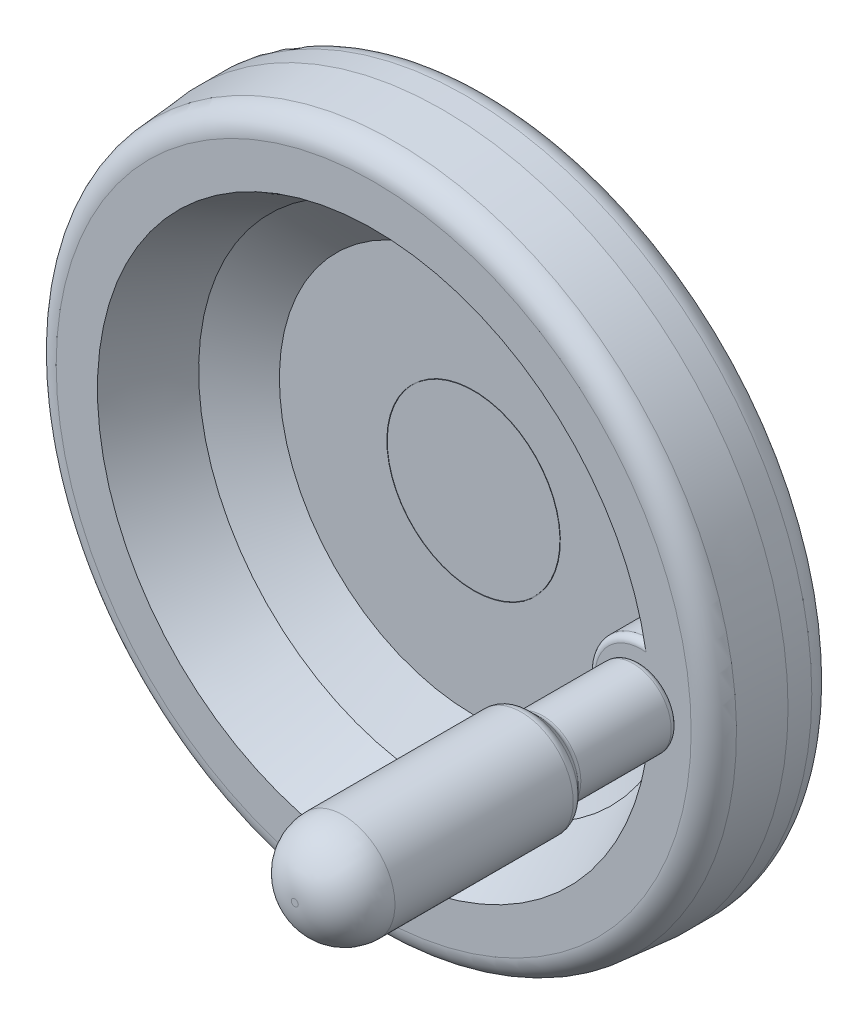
ISO-10303-21;
HEADER;
FILE_DESCRIPTION(('STEP AP214'),'2;1');
FILE_NAME('part.step','',(''),(''),'','','');
FILE_SCHEMA(('AUTOMOTIVE_DESIGN { 1 0 10303 214 1 1 1 1 }'));
ENDSEC;
DATA;
#1=APPLICATION_CONTEXT('core data for automotive mechanical design processes');
#2=APPLICATION_PROTOCOL_DEFINITION('international standard','automotive_design',2000,#1);
#3=PRODUCT_CONTEXT('',#1,'mechanical');
#4=PRODUCT('Part','Part','',(#3));
#5=PRODUCT_RELATED_PRODUCT_CATEGORY('part','',(#4));
#6=PRODUCT_DEFINITION_FORMATION('','',#4);
#7=PRODUCT_DEFINITION_CONTEXT('part definition',#1,'design');
#8=PRODUCT_DEFINITION('design','',#6,#7);
#9=PRODUCT_DEFINITION_SHAPE('','',#8);
#10=(LENGTH_UNIT() NAMED_UNIT(*) SI_UNIT(.MILLI.,.METRE.));
#11=(NAMED_UNIT(*) PLANE_ANGLE_UNIT() SI_UNIT($,.RADIAN.));
#12=(NAMED_UNIT(*) SI_UNIT($,.STERADIAN.) SOLID_ANGLE_UNIT());
#13=UNCERTAINTY_MEASURE_WITH_UNIT(LENGTH_MEASURE(1.E-05),#10,'distance_accuracy_value','');
#14=(GEOMETRIC_REPRESENTATION_CONTEXT(3) GLOBAL_UNCERTAINTY_ASSIGNED_CONTEXT((#13)) GLOBAL_UNIT_ASSIGNED_CONTEXT((#10,
#11,#12)) REPRESENTATION_CONTEXT('',''));
#15=CARTESIAN_POINT('',(0.,0.,0.));
#16=DIRECTION('',(0.,0.,1.));
#17=DIRECTION('',(1.,0.,0.));
#18=AXIS2_PLACEMENT_3D('',#15,#16,#17);
#19=CARTESIAN_POINT('',(64.,0.,64.));
#20=DIRECTION('',(0.,0.,-1.));
#21=DIRECTION('',(0.,1.,0.));
#22=AXIS2_PLACEMENT_3D('',#19,#20,#21);
#23=PLANE('',#22);
#24=CARTESIAN_POINT('',(0.,0.,64.));
#25=DIRECTION('',(0.,0.,1.));
#26=DIRECTION('',(0.,-1.,0.));
#27=AXIS2_PLACEMENT_3D('',#24,#25,#26);
#28=CIRCLE('',#27,73.560359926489);
#29=CARTESIAN_POINT('',(0.,-73.560359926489,64.));
#30=VERTEX_POINT('',#29);
#31=EDGE_CURVE('E54',#30,#30,#28,.T.);
#32=ORIENTED_EDGE('',*,*,#31,.T.);
#33=EDGE_LOOP('',(#32));
#34=FACE_BOUND('',#33,.T.);
#35=CARTESIAN_POINT('',(0.,0.,64.));
#36=DIRECTION('',(0.,0.,1.));
#37=DIRECTION('',(0.,-1.,0.));
#38=AXIS2_PLACEMENT_3D('',#35,#36,#37);
#39=CIRCLE('',#38,64.);
#40=CARTESIAN_POINT('',(63.1003024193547,10.6935417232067,64.));
#41=VERTEX_POINT('',#40);
#42=CARTESIAN_POINT('',(63.1003024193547,-10.6935417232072,64.));
#43=VERTEX_POINT('',#42);
#44=EDGE_CURVE('E49',#41,#43,#39,.T.);
#45=ORIENTED_EDGE('',*,*,#44,.F.);
#46=CARTESIAN_POINT('',(62.,0.,64.));
#47=DIRECTION('',(0.,0.,-1.));
#48=DIRECTION('',(0.,1.,0.));
#49=AXIS2_PLACEMENT_3D('',#46,#47,#48);
#50=CIRCLE('',#49,10.75);
#51=EDGE_CURVE('E52',#43,#41,#50,.T.);
#52=ORIENTED_EDGE('',*,*,#51,.F.);
#53=EDGE_LOOP('',(#45,#52));
#54=FACE_BOUND('',#53,.T.);
#55=CARTESIAN_POINT('',(62.,0.,64.));
#56=DIRECTION('',(0.,0.,-1.));
#57=DIRECTION('',(0.,1.,0.));
#58=AXIS2_PLACEMENT_3D('',#55,#56,#57);
#59=CIRCLE('',#58,4.);
#60=CARTESIAN_POINT('',(62.,4.,64.));
#61=VERTEX_POINT('',#60);
#62=EDGE_CURVE('E9',#61,#61,#59,.F.);
#63=ORIENTED_EDGE('',*,*,#62,.F.);
#64=EDGE_LOOP('',(#63));
#65=FACE_BOUND('',#64,.T.);
#66=ADVANCED_FACE('F14',(#34,#54,#65),#23,.F.);
#67=CARTESIAN_POINT('',(0.,0.,48.552282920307));
#68=DIRECTION('',(0.,0.,1.));
#69=DIRECTION('',(0.,-1.,0.));
#70=AXIS2_PLACEMENT_3D('',#67,#68,#69);
#71=CONICAL_SURFACE('',#70,56.,0.959931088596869);
#72=CARTESIAN_POINT('',(0.,0.,40.85));
#73=DIRECTION('',(0.,0.,1.));
#74=DIRECTION('',(0.,-1.,0.));
#75=AXIS2_PLACEMENT_3D('',#72,#73,#74);
#76=CIRCLE('',#75,45.);
#77=CARTESIAN_POINT('',(0.,-45.,40.85));
#78=VERTEX_POINT('',#77);
#79=EDGE_CURVE('E128',#78,#78,#76,.T.);
#80=ORIENTED_EDGE('',*,*,#79,.F.);
#81=EDGE_LOOP('',(#80));
#82=FACE_BOUND('',#81,.T.);
#83=CARTESIAN_POINT('',(55.0803991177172,10.1084926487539,48.552482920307));
#84=CARTESIAN_POINT('',(54.7990560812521,9.91588103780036,48.3343994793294));
#85=CARTESIAN_POINT('',(54.5240166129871,9.71037558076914,48.1193417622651));
#86=CARTESIAN_POINT('',(53.9882416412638,9.27329783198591,47.6970470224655));
#87=CARTESIAN_POINT('',(53.7275259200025,9.04169077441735,47.4898209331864));
#88=CARTESIAN_POINT('',(53.2206638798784,8.55051709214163,47.0837945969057));
#89=CARTESIAN_POINT('',(52.9746644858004,8.2907242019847,46.8850836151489));
#90=CARTESIAN_POINT('',(52.5023397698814,7.74513027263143,46.5006942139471));
#91=CARTESIAN_POINT('',(52.276003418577,7.45934400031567,46.315008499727));
#92=CARTESIAN_POINT('',(51.8915189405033,6.92568134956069,45.9973838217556));
#93=CARTESIAN_POINT('',(51.7291070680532,6.68267129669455,45.8624137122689));
#94=CARTESIAN_POINT('',(51.4197321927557,6.18119654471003,45.6039982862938));
#95=CARTESIAN_POINT('',(51.2727660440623,5.92273500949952,45.4805506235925));
#96=CARTESIAN_POINT('',(50.99638776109,5.39187168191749,45.2473296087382));
#97=CARTESIAN_POINT('',(50.8669208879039,5.11951721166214,45.1375137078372));
#98=CARTESIAN_POINT('',(50.6267665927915,4.56117991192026,44.9329951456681));
#99=CARTESIAN_POINT('',(50.5160761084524,4.27519931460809,44.8382900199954));
#100=CARTESIAN_POINT('',(50.3303753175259,3.73512802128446,44.678880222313));
#101=CARTESIAN_POINT('',(50.2525021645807,3.48271880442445,44.6118054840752));
#102=CARTESIAN_POINT('',(50.112630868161,2.97042488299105,44.4910525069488));
#103=CARTESIAN_POINT('',(50.0506298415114,2.71054154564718,44.4373718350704));
#104=CARTESIAN_POINT('',(49.9434134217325,2.18476653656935,44.3443863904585));
#105=CARTESIAN_POINT('',(49.8981994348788,1.91887436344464,44.3050828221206));
#106=CARTESIAN_POINT('',(49.82530268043,1.38289038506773,44.2416490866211));
#107=CARTESIAN_POINT('',(49.7976200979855,1.11279853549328,44.2175190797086));
#108=CARTESIAN_POINT('',(49.7602202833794,0.569709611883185,44.1849069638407));
#109=CARTESIAN_POINT('',(49.7505504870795,0.29670676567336,44.1764661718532));
#110=CARTESIAN_POINT('',(49.7494952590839,-0.249361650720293,44.1755453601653));
#111=CARTESIAN_POINT('',(49.758109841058,-0.522427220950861,44.1830653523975));
#112=CARTESIAN_POINT('',(49.7934676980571,-1.06648410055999,44.2138993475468));
#113=CARTESIAN_POINT('',(49.8202115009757,-1.33747534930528,44.2372138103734));
#114=CARTESIAN_POINT('',(49.8913596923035,-1.87534679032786,44.2991351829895));
#115=CARTESIAN_POINT('',(49.9357640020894,-2.14222700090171,44.3377420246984));
#116=CARTESIAN_POINT('',(50.0393527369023,-2.65934587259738,44.4275998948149));
#117=CARTESIAN_POINT('',(50.0978649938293,-2.90982056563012,44.4782748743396));
#118=CARTESIAN_POINT('',(50.2296486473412,-3.40392551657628,44.5920982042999));
#119=CARTESIAN_POINT('',(50.3029192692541,-3.6475561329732,44.6552459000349));
#120=CARTESIAN_POINT('',(50.4633187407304,-4.12690872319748,44.793045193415));
#121=CARTESIAN_POINT('',(50.5504502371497,-4.36262917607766,44.867698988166));
#122=CARTESIAN_POINT('',(50.7375993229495,-4.82525998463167,45.0274703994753));
#123=CARTESIAN_POINT('',(50.8376195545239,-5.05216852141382,45.1125901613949));
#124=CARTESIAN_POINT('',(51.0888440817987,-5.57878934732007,45.3255379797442));
#125=CARTESIAN_POINT('',(51.2452879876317,-5.87435141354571,45.4575101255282));
#126=CARTESIAN_POINT('',(51.5781172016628,-6.44643721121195,45.7365633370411));
#127=CARTESIAN_POINT('',(51.7545095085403,-6.7229542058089,45.8836497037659));
#128=CARTESIAN_POINT('',(52.3110228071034,-7.52389425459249,46.3446292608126));
#129=CARTESIAN_POINT('',(52.7181070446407,-8.01894307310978,46.6779240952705));
#130=CARTESIAN_POINT('',(53.4514783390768,-8.78476663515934,47.2694572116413));
#131=CARTESIAN_POINT('',(53.7631781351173,-9.07724211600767,47.5185393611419));
#132=CARTESIAN_POINT('',(54.2465305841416,-9.48632401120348,47.9008371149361));
#133=CARTESIAN_POINT('',(54.4097675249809,-9.61739597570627,48.0293162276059));
#134=CARTESIAN_POINT('',(54.7413520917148,-9.87005514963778,48.2889750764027));
#135=CARTESIAN_POINT('',(54.9096996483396,-9.99164248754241,48.4201547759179));
#136=CARTESIAN_POINT('',(55.0803991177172,-10.1084926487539,48.552482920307));
#137=B_SPLINE_CURVE_WITH_KNOTS('',3,(#83,#84,#85,#86,#87,#88,#89,#90,#91,#92,#93,#94,#95,#96,
#97,#98,#99,#100,#101,#102,#103,#104,#105,#106,#107,#108,#109,#110,#111,#112,#113,#114,#115,
#116,#117,#118,#119,#120,#121,#122,#123,#124,#125,#126,#127,#128,#129,#130,#131,#132,#133,#134,
#135,#136),.UNSPECIFIED.,.F.,.F.,(4,2,2,2,2,2,2,2,2,2,2,2,2,2,2,2,2,2,2,2,2,2,2,2,2,2,4),(0.,
1.21413799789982,2.42991270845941,3.65629248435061,4.88197985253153,5.84695735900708,
6.81173794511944,7.77342711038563,8.73495927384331,9.55172094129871,10.3683341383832,
11.1850157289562,12.0017059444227,12.8205438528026,13.6393823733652,14.458244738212,
15.2771034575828,16.0627654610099,16.8483862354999,17.6341572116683,18.4200895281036,
19.4970136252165,20.5743167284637,22.7316118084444,24.2137337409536,24.9503776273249,
25.6870115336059),.UNSPECIFIED.);
#138=CARTESIAN_POINT('',(55.0801411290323,10.1083160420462,48.552282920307));
#139=VERTEX_POINT('',#138);
#140=CARTESIAN_POINT('',(55.0801411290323,-10.1083160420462,48.552282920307));
#141=VERTEX_POINT('',#140);
#142=EDGE_CURVE('E185',#139,#141,#137,.T.);
#143=ORIENTED_EDGE('',*,*,#142,.F.);
#144=CARTESIAN_POINT('',(0.,0.,48.552282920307));
#145=DIRECTION('',(0.,0.,1.));
#146=DIRECTION('',(0.,-1.,0.));
#147=AXIS2_PLACEMENT_3D('',#144,#145,#146);
#148=CIRCLE('',#147,56.);
#149=EDGE_CURVE('E53',#139,#141,#148,.T.);
#150=ORIENTED_EDGE('',*,*,#149,.T.);
#151=EDGE_LOOP('',(#143,#150));
#152=FACE_BOUND('',#151,.T.);
#153=ADVANCED_FACE('F190',(#82,#152),#71,.F.);
#154=CARTESIAN_POINT('',(0.,0.,64.));
#155=DIRECTION('',(0.,0.,1.));
#156=DIRECTION('',(0.,-1.,0.));
#157=AXIS2_PLACEMENT_3D('',#154,#155,#156);
#158=CONICAL_SURFACE('',#157,64.,0.477845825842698);
#159=CARTESIAN_POINT('',(55.0800475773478,-10.1082519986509,48.552082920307));
#160=CARTESIAN_POINT('',(55.2141896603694,-10.2000759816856,48.8388603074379));
#161=CARTESIAN_POINT('',(55.3491732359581,-10.2885705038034,49.126294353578));
#162=CARTESIAN_POINT('',(55.6207504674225,-10.4591308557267,49.7022947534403));
#163=CARTESIAN_POINT('',(55.7573440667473,-10.5411969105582,49.9908610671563));
#164=CARTESIAN_POINT('',(56.1693866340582,-10.778073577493,50.8578948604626));
#165=CARTESIAN_POINT('',(56.4471541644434,-10.92360133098,51.4378186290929));
#166=CARTESIAN_POINT('',(57.0069714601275,-11.1905239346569,52.5974490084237));
#167=CARTESIAN_POINT('',(57.2889935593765,-11.3120335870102,53.1771427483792));
#168=CARTESIAN_POINT('',(57.8582648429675,-11.5326368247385,54.3382667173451));
#169=CARTESIAN_POINT('',(58.1455143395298,-11.6317290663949,54.9196970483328));
#170=CARTESIAN_POINT('',(58.7248258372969,-11.8079371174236,56.0833946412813));
#171=CARTESIAN_POINT('',(59.0168872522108,-11.8850555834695,56.6656617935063));
#172=CARTESIAN_POINT('',(59.605503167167,-12.0174822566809,57.8303746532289));
#173=CARTESIAN_POINT('',(59.9020575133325,-12.0727912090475,58.412820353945));
#174=CARTESIAN_POINT('',(60.5008128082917,-12.1617019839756,59.5801404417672));
#175=CARTESIAN_POINT('',(60.8030344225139,-12.1951951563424,60.1650126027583));
#176=CARTESIAN_POINT('',(61.2592399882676,-12.2285327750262,61.0414551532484));
#177=CARTESIAN_POINT('',(61.4117935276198,-12.2368282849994,61.3334700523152));
#178=CARTESIAN_POINT('',(61.7178122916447,-12.2477058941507,61.9171309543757));
#179=CARTESIAN_POINT('',(61.8712775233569,-12.2502879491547,62.2087769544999));
#180=CARTESIAN_POINT('',(62.0251763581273,-12.2499741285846,62.5002));
#181=B_SPLINE_CURVE_WITH_KNOTS('',3,(#159,#160,#161,#162,#163,#164,#165,#166,#167,#168,#169,
#170,#171,#172,#173,#174,#175,#176,#177,#178,#179,#180),.UNSPECIFIED.,.F.,.F.,(4,2,2,2,2,2,2,2,
2,2,4),(0.,0.988897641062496,1.97776065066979,3.95506841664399,5.92268345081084,
7.89041639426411,9.85791133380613,11.8253390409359,13.8024917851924,14.7911472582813,
15.7798103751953),.UNSPECIFIED.);
#182=CARTESIAN_POINT('',(62.0250707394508,-12.2499743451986,62.5));
#183=VERTEX_POINT('',#182);
#184=EDGE_CURVE('E22',#141,#183,#181,.T.);
#185=ORIENTED_EDGE('',*,*,#184,.F.);
#186=ORIENTED_EDGE('',*,*,#149,.F.);
#187=CARTESIAN_POINT('',(62.0251763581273,12.2499741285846,62.5002));
#188=CARTESIAN_POINT('',(61.8712775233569,12.2502879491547,62.2087769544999));
#189=CARTESIAN_POINT('',(61.7178122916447,12.2477058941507,61.9171309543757));
#190=CARTESIAN_POINT('',(61.4117935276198,12.2368282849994,61.3334700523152));
#191=CARTESIAN_POINT('',(61.2592399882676,12.2285327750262,61.0414551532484));
#192=CARTESIAN_POINT('',(60.8030344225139,12.1951951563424,60.1650126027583));
#193=CARTESIAN_POINT('',(60.5008128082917,12.1617019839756,59.5801404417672));
#194=CARTESIAN_POINT('',(59.9020575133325,12.0727912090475,58.412820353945));
#195=CARTESIAN_POINT('',(59.605503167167,12.0174822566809,57.8303746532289));
#196=CARTESIAN_POINT('',(59.0168872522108,11.8850555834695,56.6656617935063));
#197=CARTESIAN_POINT('',(58.7248258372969,11.8079371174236,56.0833946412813));
#198=CARTESIAN_POINT('',(58.1455143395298,11.6317290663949,54.9196970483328));
#199=CARTESIAN_POINT('',(57.8582648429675,11.5326368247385,54.3382667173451));
#200=CARTESIAN_POINT('',(57.2889935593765,11.3120335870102,53.1771427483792));
#201=CARTESIAN_POINT('',(57.0069714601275,11.1905239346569,52.5974490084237));
#202=CARTESIAN_POINT('',(56.4471541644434,10.92360133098,51.4378186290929));
#203=CARTESIAN_POINT('',(56.1693866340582,10.778073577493,50.8578948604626));
#204=CARTESIAN_POINT('',(55.7573440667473,10.5411969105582,49.9908610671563));
#205=CARTESIAN_POINT('',(55.6207504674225,10.4591308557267,49.7022947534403));
#206=CARTESIAN_POINT('',(55.3491732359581,10.2885705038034,49.126294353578));
#207=CARTESIAN_POINT('',(55.2141896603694,10.2000759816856,48.8388603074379));
#208=CARTESIAN_POINT('',(55.0800475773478,10.1082519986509,48.552082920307));
#209=B_SPLINE_CURVE_WITH_KNOTS('',3,(#187,#188,#189,#190,#191,#192,#193,#194,#195,#196,#197,
#198,#199,#200,#201,#202,#203,#204,#205,#206,#207,#208),.UNSPECIFIED.,.F.,.F.,(4,2,2,2,2,2,2,2,
2,2,4),(0.,0.988663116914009,1.97731859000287,3.9544713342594,5.92189904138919,7.88939398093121,
9.85712692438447,11.8247419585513,13.8020497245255,14.7909127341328,15.7798103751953),.UNSPECIFIED.);
#210=CARTESIAN_POINT('',(62.0250707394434,12.2499743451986,62.4999999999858));
#211=VERTEX_POINT('',#210);
#212=EDGE_CURVE('E36',#211,#139,#209,.T.);
#213=ORIENTED_EDGE('',*,*,#212,.F.);
#214=CARTESIAN_POINT('',(62.5451264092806,9.23392318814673,62.4998));
#215=CARTESIAN_POINT('',(62.5918775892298,9.23113623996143,62.5883346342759));
#216=CARTESIAN_POINT('',(62.6379822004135,9.23592082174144,62.6777472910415));
#217=CARTESIAN_POINT('',(62.7275873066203,9.26163287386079,62.8561577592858));
#218=CARTESIAN_POINT('',(62.7710715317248,9.2826518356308,62.9451503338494));
#219=CARTESIAN_POINT('',(62.8471972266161,9.33731788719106,63.1060395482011));
#220=CARTESIAN_POINT('',(62.880476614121,9.36851732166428,63.1784560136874));
#221=CARTESIAN_POINT('',(62.9425576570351,9.44347670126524,63.3184171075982));
#222=CARTESIAN_POINT('',(62.971368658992,9.48720986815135,63.38597174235));
#223=CARTESIAN_POINT('',(63.0234477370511,9.58739942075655,63.5143601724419));
#224=CARTESIAN_POINT('',(63.0466719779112,9.64395006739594,63.575138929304));
#225=CARTESIAN_POINT('',(63.0859458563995,9.76838432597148,63.6866431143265));
#226=CARTESIAN_POINT('',(63.1019981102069,9.83626379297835,63.7373722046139));
#227=CARTESIAN_POINT('',(63.1244588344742,9.97198974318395,63.8208662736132));
#228=CARTESIAN_POINT('',(63.1318172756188,10.0387937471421,63.8550797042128));
#229=CARTESIAN_POINT('',(63.1400020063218,10.1771876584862,63.9129316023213));
#230=CARTESIAN_POINT('',(63.1408303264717,10.2487760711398,63.9365733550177));
#231=CARTESIAN_POINT('',(63.1361553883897,10.391408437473,63.9720987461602));
#232=CARTESIAN_POINT('',(63.1309142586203,10.4623510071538,63.9844308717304));
#233=CARTESIAN_POINT('',(63.1148889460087,10.6046237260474,63.9991271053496));
#234=CARTESIAN_POINT('',(63.1041038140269,10.6759539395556,64.0014895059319));
#235=CARTESIAN_POINT('',(63.0766716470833,10.821815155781,63.9965655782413));
#236=CARTESIAN_POINT('',(63.0596962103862,10.8962622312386,63.9886577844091));
#237=CARTESIAN_POINT('',(63.020801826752,11.0420739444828,63.9629319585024));
#238=CARTESIAN_POINT('',(62.9988808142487,11.1134372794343,63.9451097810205));
#239=CARTESIAN_POINT('',(62.9480017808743,11.2599662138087,63.8978464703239));
#240=CARTESIAN_POINT('',(62.918518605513,11.3345867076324,63.8672823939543));
#241=CARTESIAN_POINT('',(62.8553053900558,11.4769857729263,63.7962491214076));
#242=CARTESIAN_POINT('',(62.8215734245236,11.5447612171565,63.7557754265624));
#243=CARTESIAN_POINT('',(62.7463790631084,11.6803540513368,63.6605999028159));
#244=CARTESIAN_POINT('',(62.7044770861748,11.7471260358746,63.6047540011));
#245=CARTESIAN_POINT('',(62.6176948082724,11.8694577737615,63.4838232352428));
#246=CARTESIAN_POINT('',(62.5728126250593,11.9250103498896,63.418732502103));
#247=CARTESIAN_POINT('',(62.4770659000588,12.0283603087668,63.2746848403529));
#248=CARTESIAN_POINT('',(62.4260285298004,12.0749927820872,63.1950051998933));
#249=CARTESIAN_POINT('',(62.3232784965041,12.152473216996,63.0287604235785));
#250=CARTESIAN_POINT('',(62.2715663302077,12.1833321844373,62.942200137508));
#251=CARTESIAN_POINT('',(62.1870992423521,12.2203276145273,62.7958994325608));
#252=CARTESIAN_POINT('',(62.1541035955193,12.2313470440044,62.7374922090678));
#253=CARTESIAN_POINT('',(62.0888765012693,12.2461380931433,62.6194382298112));
#254=CARTESIAN_POINT('',(62.0566442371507,12.2499178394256,62.5597929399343));
#255=CARTESIAN_POINT('',(62.0249651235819,12.2499745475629,62.4998));
#256=B_SPLINE_CURVE_WITH_KNOTS('',3,(#214,#215,#216,#217,#218,#219,#220,#221,#222,#223,#224,
#225,#226,#227,#228,#229,#230,#231,#232,#233,#234,#235,#236,#237,#238,#239,#240,#241,#242,#243,
#244,#245,#246,#247,#248,#249,#250,#251,#252,#253,#254,#255),.UNSPECIFIED.,.F.,.F.,(4,2,2,2,2,2,
2,2,2,2,2,2,2,2,2,2,2,2,2,2,4),(0.,0.30061619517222,0.602939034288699,0.858633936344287,
1.11378656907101,1.37088027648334,1.62788012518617,1.85296835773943,2.07798659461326,
2.29363802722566,2.50932639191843,2.73869460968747,2.96815880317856,3.22470170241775,
3.4813612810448,3.76997636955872,4.05877550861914,4.37384172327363,4.68868780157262,
4.89226097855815,5.09560550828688),.UNSPECIFIED.);
#257=EDGE_CURVE('E56',#41,#211,#256,.T.);
#258=ORIENTED_EDGE('',*,*,#257,.F.);
#259=ORIENTED_EDGE('',*,*,#44,.T.);
#260=CARTESIAN_POINT('',(62.0249651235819,-12.2499745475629,62.4998));
#261=CARTESIAN_POINT('',(62.0746697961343,-12.2499150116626,62.5939492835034));
#262=CARTESIAN_POINT('',(62.1257534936,-12.2406350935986,62.6872404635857));
#263=CARTESIAN_POINT('',(62.2290858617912,-12.2046549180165,62.8696173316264));
#264=CARTESIAN_POINT('',(62.2813332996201,-12.1779723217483,62.9587071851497));
#265=CARTESIAN_POINT('',(62.3854746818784,-12.1082246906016,63.1303392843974));
#266=CARTESIAN_POINT('',(62.4373688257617,-12.0651698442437,63.2128855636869));
#267=CARTESIAN_POINT('',(62.5393588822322,-11.9638265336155,63.369334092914));
#268=CARTESIAN_POINT('',(62.5894543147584,-11.9055340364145,63.4432340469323));
#269=CARTESIAN_POINT('',(62.6871025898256,-11.7739477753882,63.5813148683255));
#270=CARTESIAN_POINT('',(62.7345997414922,-11.7004220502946,63.6453149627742));
#271=CARTESIAN_POINT('',(62.8244222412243,-11.5406342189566,63.7597047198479));
#272=CARTESIAN_POINT('',(62.8667478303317,-11.4543727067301,63.810095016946));
#273=CARTESIAN_POINT('',(62.9421960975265,-11.2763590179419,63.8923611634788));
#274=CARTESIAN_POINT('',(62.975697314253,-11.1851711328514,63.9251040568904));
#275=CARTESIAN_POINT('',(63.034643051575,-10.9959375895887,63.9738576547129));
#276=CARTESIAN_POINT('',(63.0600953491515,-10.8978986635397,63.9898845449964));
#277=CARTESIAN_POINT('',(63.0986754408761,-10.7107469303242,64.0023376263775));
#278=CARTESIAN_POINT('',(63.1129316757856,-10.6220134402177,64.0009260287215));
#279=CARTESIAN_POINT('',(63.132846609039,-10.445182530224,63.9826548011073));
#280=CARTESIAN_POINT('',(63.1385161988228,-10.3570844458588,63.9658147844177));
#281=CARTESIAN_POINT('',(63.1405111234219,-10.196942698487,63.9199652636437));
#282=CARTESIAN_POINT('',(63.1380028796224,-10.1243455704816,63.8929232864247));
#283=CARTESIAN_POINT('',(63.1261271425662,-9.98484334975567,63.8279098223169));
#284=CARTESIAN_POINT('',(63.1167628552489,-9.91793561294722,63.7899434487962));
#285=CARTESIAN_POINT('',(63.0924673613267,-9.79624755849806,63.7073345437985));
#286=CARTESIAN_POINT('',(63.0779579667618,-9.74095197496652,63.6633214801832));
#287=CARTESIAN_POINT('',(63.0439919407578,-9.63839406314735,63.5684186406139));
#288=CARTESIAN_POINT('',(63.024535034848,-9.59113218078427,63.517528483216));
#289=CARTESIAN_POINT('',(62.9805692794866,-9.5035877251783,63.408260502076));
#290=CARTESIAN_POINT('',(62.9558857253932,-9.46367163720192,63.3496609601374));
#291=CARTESIAN_POINT('',(62.9029106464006,-9.39354029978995,63.2284311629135));
#292=CARTESIAN_POINT('',(62.874616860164,-9.36333117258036,63.1657983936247));
#293=CARTESIAN_POINT('',(62.8113554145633,-9.30913992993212,63.0295898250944));
#294=CARTESIAN_POINT('',(62.7759997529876,-9.28650539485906,62.955660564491));
#295=CARTESIAN_POINT('',(62.702835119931,-9.25302351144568,62.8064492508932));
#296=CARTESIAN_POINT('',(62.6650269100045,-9.24217252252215,62.7311676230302));
#297=CARTESIAN_POINT('',(62.5996575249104,-9.23326318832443,62.6037843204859));
#298=CARTESIAN_POINT('',(62.5725129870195,-9.23230062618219,62.5516600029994));
#299=CARTESIAN_POINT('',(62.5451264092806,-9.23392318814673,62.4998));
#300=B_SPLINE_CURVE_WITH_KNOTS('',3,(#260,#261,#262,#263,#264,#265,#266,#267,#268,#269,#270,
#271,#272,#273,#274,#275,#276,#277,#278,#279,#280,#281,#282,#283,#284,#285,#286,#287,#288,#289,
#290,#291,#292,#293,#294,#295,#296,#297,#298,#299),.UNSPECIFIED.,.F.,.F.,(4,2,2,2,2,2,2,2,2,2,2,
2,2,2,2,2,2,2,2,4),(0.,0.318837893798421,0.637352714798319,0.955669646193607,1.27407091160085,
1.59773335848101,1.92138071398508,2.22719801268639,2.53271891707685,2.80078175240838,
3.06850428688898,3.29980051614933,3.53098865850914,3.74645732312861,3.96193794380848,
4.18627085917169,4.41074498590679,4.66483785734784,4.91885220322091,5.09490195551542),.UNSPECIFIED.);
#301=EDGE_CURVE('E29',#183,#43,#300,.T.);
#302=ORIENTED_EDGE('',*,*,#301,.F.);
#303=EDGE_LOOP('',(#185,#186,#213,#258,#259,#302));
#304=FACE_BOUND('',#303,.T.);
#305=ADVANCED_FACE('F57',(#304),#158,.F.);
#306=CARTESIAN_POINT('',(0.,0.,40.85));
#307=DIRECTION('',(0.,0.,-1.));
#308=DIRECTION('',(0.,1.,0.));
#309=AXIS2_PLACEMENT_3D('',#306,#307,#308);
#310=PLANE('',#309);
#311=CARTESIAN_POINT('',(0.,0.,40.85));
#312=DIRECTION('',(0.,0.,1.));
#313=DIRECTION('',(0.,-1.,0.));
#314=AXIS2_PLACEMENT_3D('',#311,#312,#313);
#315=CIRCLE('',#314,20.);
#316=CARTESIAN_POINT('',(0.,-20.,40.85));
#317=VERTEX_POINT('',#316);
#318=EDGE_CURVE('E114',#317,#317,#315,.T.);
#319=ORIENTED_EDGE('',*,*,#318,.T.);
#320=EDGE_LOOP('',(#319));
#321=FACE_BOUND('',#320,.T.);
#322=ADVANCED_FACE('F16',(#321),#310,.F.);
#323=CARTESIAN_POINT('',(0.,0.,39.));
#324=DIRECTION('',(0.,0.,1.));
#325=DIRECTION('',(0.,-1.,0.));
#326=AXIS2_PLACEMENT_3D('',#323,#324,#325);
#327=CYLINDRICAL_SURFACE('',#326,20.);
#328=ORIENTED_EDGE('',*,*,#318,.F.);
#329=EDGE_LOOP('',(#328));
#330=FACE_BOUND('',#329,.T.);
#331=CARTESIAN_POINT('',(0.,0.,40.6));
#332=DIRECTION('',(0.,0.,1.));
#333=DIRECTION('',(0.,-1.,0.));
#334=AXIS2_PLACEMENT_3D('',#331,#332,#333);
#335=CIRCLE('',#334,20.);
#336=CARTESIAN_POINT('',(0.,-20.,40.6));
#337=VERTEX_POINT('',#336);
#338=EDGE_CURVE('E116',#337,#337,#335,.T.);
#339=ORIENTED_EDGE('',*,*,#338,.T.);
#340=EDGE_LOOP('',(#339));
#341=FACE_BOUND('',#340,.T.);
#342=ADVANCED_FACE('F206',(#330,#341),#327,.T.);
#343=CARTESIAN_POINT('',(20.,0.,40.6));
#344=DIRECTION('',(0.,0.,-1.));
#345=DIRECTION('',(0.,1.,0.));
#346=AXIS2_PLACEMENT_3D('',#343,#344,#345);
#347=PLANE('',#346);
#348=ORIENTED_EDGE('',*,*,#338,.F.);
#349=EDGE_LOOP('',(#348));
#350=FACE_BOUND('',#349,.T.);
#351=CARTESIAN_POINT('',(0.,0.,40.6));
#352=DIRECTION('',(0.,0.,1.));
#353=DIRECTION('',(0.,-1.,0.));
#354=AXIS2_PLACEMENT_3D('',#351,#352,#353);
#355=CIRCLE('',#354,20.1);
#356=CARTESIAN_POINT('',(0.,-20.1,40.6));
#357=VERTEX_POINT('',#356);
#358=EDGE_CURVE('E120',#357,#357,#355,.T.);
#359=ORIENTED_EDGE('',*,*,#358,.T.);
#360=EDGE_LOOP('',(#359));
#361=FACE_BOUND('',#360,.T.);
#362=ADVANCED_FACE('F203',(#350,#361),#347,.F.);
#363=CARTESIAN_POINT('',(0.,0.,39.));
#364=DIRECTION('',(0.,0.,1.));
#365=DIRECTION('',(0.,-1.,0.));
#366=AXIS2_PLACEMENT_3D('',#363,#364,#365);
#367=CYLINDRICAL_SURFACE('',#366,20.1);
#368=ORIENTED_EDGE('',*,*,#358,.F.);
#369=EDGE_LOOP('',(#368));
#370=FACE_BOUND('',#369,.T.);
#371=CARTESIAN_POINT('',(0.,0.,40.85));
#372=DIRECTION('',(0.,0.,1.));
#373=DIRECTION('',(0.,-1.,0.));
#374=AXIS2_PLACEMENT_3D('',#371,#372,#373);
#375=CIRCLE('',#374,20.1);
#376=CARTESIAN_POINT('',(0.,-20.1,40.85));
#377=VERTEX_POINT('',#376);
#378=EDGE_CURVE('E125',#377,#377,#375,.T.);
#379=ORIENTED_EDGE('',*,*,#378,.T.);
#380=EDGE_LOOP('',(#379));
#381=FACE_BOUND('',#380,.T.);
#382=ADVANCED_FACE('F199',(#370,#381),#367,.F.);
#383=CARTESIAN_POINT('',(20.1,0.,40.85));
#384=DIRECTION('',(0.,0.,-1.));
#385=DIRECTION('',(0.,1.,0.));
#386=AXIS2_PLACEMENT_3D('',#383,#384,#385);
#387=PLANE('',#386);
#388=ORIENTED_EDGE('',*,*,#378,.F.);
#389=EDGE_LOOP('',(#388));
#390=FACE_BOUND('',#389,.T.);
#391=ORIENTED_EDGE('',*,*,#79,.T.);
#392=EDGE_LOOP('',(#391));
#393=FACE_BOUND('',#392,.T.);
#394=ADVANCED_FACE('F195',(#390,#393),#387,.F.);
#395=CARTESIAN_POINT('',(0.,0.,58.5000000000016));
#396=DIRECTION('',(0.,0.,1.));
#397=DIRECTION('',(0.,-1.,0.));
#398=AXIS2_PLACEMENT_3D('',#395,#396,#397);
#399=TOROIDAL_SURFACE('',#398,73.5603599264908,5.49999999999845);
#400=ORIENTED_EDGE('',*,*,#31,.F.);
#401=EDGE_LOOP('',(#400));
#402=FACE_BOUND('',#401,.T.);
#403=CARTESIAN_POINT('',(0.,0.,58.979356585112));
#404=DIRECTION('',(0.,0.,1.));
#405=DIRECTION('',(0.,-1.,0.));
#406=AXIS2_PLACEMENT_3D('',#403,#404,#405);
#407=CIRCLE('',#406,79.039430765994);
#408=CARTESIAN_POINT('',(0.,-79.039430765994,58.979356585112));
#409=VERTEX_POINT('',#408);
#410=EDGE_CURVE('E135',#409,#409,#407,.T.);
#411=ORIENTED_EDGE('',*,*,#410,.T.);
#412=EDGE_LOOP('',(#411));
#413=FACE_BOUND('',#412,.T.);
#414=ADVANCED_FACE('F198',(#402,#413),#399,.T.);
#415=CARTESIAN_POINT('',(0.,0.,48.));
#416=DIRECTION('',(0.,0.,-1.));
#417=DIRECTION('',(0.,1.,0.));
#418=AXIS2_PLACEMENT_3D('',#415,#416,#417);
#419=CONICAL_SURFACE('',#418,80.,0.0872664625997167);
#420=ORIENTED_EDGE('',*,*,#410,.F.);
#421=EDGE_LOOP('',(#420));
#422=FACE_BOUND('',#421,.T.);
#423=CARTESIAN_POINT('',(0.,0.,48.));
#424=DIRECTION('',(0.,0.,1.));
#425=DIRECTION('',(0.,-1.,0.));
#426=AXIS2_PLACEMENT_3D('',#423,#424,#425);
#427=CIRCLE('',#426,80.);
#428=CARTESIAN_POINT('',(0.,-80.,48.));
#429=VERTEX_POINT('',#428);
#430=EDGE_CURVE('E138',#429,#429,#427,.T.);
#431=ORIENTED_EDGE('',*,*,#430,.T.);
#432=EDGE_LOOP('',(#431));
#433=FACE_BOUND('',#432,.T.);
#434=ADVANCED_FACE('F224',(#422,#433),#419,.T.);
#435=CARTESIAN_POINT('',(0.,0.,39.));
#436=DIRECTION('',(0.,0.,1.));
#437=DIRECTION('',(0.,-1.,0.));
#438=AXIS2_PLACEMENT_3D('',#435,#436,#437);
#439=CYLINDRICAL_SURFACE('',#438,80.);
#440=ORIENTED_EDGE('',*,*,#430,.F.);
#441=EDGE_LOOP('',(#440));
#442=FACE_BOUND('',#441,.T.);
#443=CARTESIAN_POINT('',(0.,0.,42.5));
#444=DIRECTION('',(0.,0.,1.));
#445=DIRECTION('',(0.,-1.,0.));
#446=AXIS2_PLACEMENT_3D('',#443,#444,#445);
#447=CIRCLE('',#446,80.);
#448=CARTESIAN_POINT('',(0.,-80.,42.5));
#449=VERTEX_POINT('',#448);
#450=EDGE_CURVE('E141',#449,#449,#447,.T.);
#451=ORIENTED_EDGE('',*,*,#450,.T.);
#452=EDGE_LOOP('',(#451));
#453=FACE_BOUND('',#452,.T.);
#454=ADVANCED_FACE('F228',(#442,#453),#439,.T.);
#455=CARTESIAN_POINT('',(0.,0.,42.5));
#456=DIRECTION('',(0.,0.,1.));
#457=DIRECTION('',(0.,-1.,0.));
#458=AXIS2_PLACEMENT_3D('',#455,#456,#457);
#459=TOROIDAL_SURFACE('',#458,74.5,5.50000000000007);
#460=ORIENTED_EDGE('',*,*,#450,.F.);
#461=EDGE_LOOP('',(#460));
#462=FACE_BOUND('',#461,.T.);
#463=CARTESIAN_POINT('',(0.,0.,37.));
#464=DIRECTION('',(0.,0.,1.));
#465=DIRECTION('',(0.,-1.,0.));
#466=AXIS2_PLACEMENT_3D('',#463,#464,#465);
#467=CIRCLE('',#466,74.5);
#468=CARTESIAN_POINT('',(0.,-74.5,37.));
#469=VERTEX_POINT('',#468);
#470=EDGE_CURVE('E144',#469,#469,#467,.T.);
#471=ORIENTED_EDGE('',*,*,#470,.T.);
#472=EDGE_LOOP('',(#471));
#473=FACE_BOUND('',#472,.T.);
#474=ADVANCED_FACE('F232',(#462,#473),#459,.T.);
#475=CARTESIAN_POINT('',(74.5,0.,37.));
#476=DIRECTION('',(0.,0.,1.));
#477=DIRECTION('',(0.,-1.,0.));
#478=AXIS2_PLACEMENT_3D('',#475,#476,#477);
#479=PLANE('',#478);
#480=ORIENTED_EDGE('',*,*,#470,.F.);
#481=EDGE_LOOP('',(#480));
#482=FACE_BOUND('',#481,.T.);
#483=CARTESIAN_POINT('',(0.,0.,37.));
#484=DIRECTION('',(0.,0.,1.));
#485=DIRECTION('',(0.,-1.,0.));
#486=AXIS2_PLACEMENT_3D('',#483,#484,#485);
#487=CIRCLE('',#486,57.05920321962);
#488=CARTESIAN_POINT('',(0.,-57.05920321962,37.));
#489=VERTEX_POINT('',#488);
#490=EDGE_CURVE('E147',#489,#489,#487,.T.);
#491=ORIENTED_EDGE('',*,*,#490,.T.);
#492=EDGE_LOOP('',(#491));
#493=FACE_BOUND('',#492,.T.);
#494=ADVANCED_FACE('F236',(#482,#493),#479,.F.);
#495=CARTESIAN_POINT('',(0.,0.,31.5000000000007));
#496=DIRECTION('',(0.,0.,1.));
#497=DIRECTION('',(0.,-1.,0.));
#498=AXIS2_PLACEMENT_3D('',#495,#496,#497);
#499=TOROIDAL_SURFACE('',#498,57.0592032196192,5.49999999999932);
#500=ORIENTED_EDGE('',*,*,#490,.F.);
#501=EDGE_LOOP('',(#500));
#502=FACE_BOUND('',#501,.T.);
#503=CARTESIAN_POINT('',(0.,0.,36.606621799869));
#504=DIRECTION('',(0.,0.,1.));
#505=DIRECTION('',(0.,-1.,0.));
#506=AXIS2_PLACEMENT_3D('',#503,#504,#505);
#507=CIRCLE('',#506,55.016554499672);
#508=CARTESIAN_POINT('',(0.,-55.016554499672,36.606621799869));
#509=VERTEX_POINT('',#508);
#510=EDGE_CURVE('E150',#509,#509,#507,.T.);
#511=ORIENTED_EDGE('',*,*,#510,.T.);
#512=EDGE_LOOP('',(#511));
#513=FACE_BOUND('',#512,.T.);
#514=ADVANCED_FACE('F240',(#502,#513),#499,.F.);
#515=CARTESIAN_POINT('',(0.,0.,25.182940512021));
#516=DIRECTION('',(0.,0.,1.));
#517=DIRECTION('',(0.,-1.,0.));
#518=AXIS2_PLACEMENT_3D('',#515,#516,#517);
#519=CONICAL_SURFACE('',#518,26.457351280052,1.19028994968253);
#520=ORIENTED_EDGE('',*,*,#510,.F.);
#521=EDGE_LOOP('',(#520));
#522=FACE_BOUND('',#521,.T.);
#523=CARTESIAN_POINT('',(0.,0.,25.182940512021));
#524=DIRECTION('',(0.,0.,1.));
#525=DIRECTION('',(0.,-1.,0.));
#526=AXIS2_PLACEMENT_3D('',#523,#524,#525);
#527=CIRCLE('',#526,26.457351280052);
#528=CARTESIAN_POINT('',(0.,-26.457351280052,25.182940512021));
#529=VERTEX_POINT('',#528);
#530=EDGE_CURVE('E153',#529,#529,#527,.T.);
#531=ORIENTED_EDGE('',*,*,#530,.T.);
#532=EDGE_LOOP('',(#531));
#533=FACE_BOUND('',#532,.T.);
#534=ADVANCED_FACE('F244',(#522,#533),#519,.T.);
#535=CARTESIAN_POINT('',(0.,0.,20.0763187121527));
#536=DIRECTION('',(0.,0.,1.));
#537=DIRECTION('',(0.,-1.,0.));
#538=AXIS2_PLACEMENT_3D('',#535,#536,#537);
#539=TOROIDAL_SURFACE('',#538,28.4999999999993,5.49999999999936);
#540=ORIENTED_EDGE('',*,*,#530,.F.);
#541=EDGE_LOOP('',(#540));
#542=FACE_BOUND('',#541,.T.);
#543=CARTESIAN_POINT('',(0.,0.,20.076318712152));
#544=DIRECTION('',(0.,0.,1.));
#545=DIRECTION('',(0.,-1.,0.));
#546=AXIS2_PLACEMENT_3D('',#543,#544,#545);
#547=CIRCLE('',#546,23.);
#548=CARTESIAN_POINT('',(0.,-23.,20.076318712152));
#549=VERTEX_POINT('',#548);
#550=EDGE_CURVE('E156',#549,#549,#547,.T.);
#551=ORIENTED_EDGE('',*,*,#550,.T.);
#552=EDGE_LOOP('',(#551));
#553=FACE_BOUND('',#552,.T.);
#554=ADVANCED_FACE('F248',(#542,#553),#539,.F.);
#555=CARTESIAN_POINT('',(0.,0.,39.));
#556=DIRECTION('',(0.,0.,1.));
#557=DIRECTION('',(0.,-1.,0.));
#558=AXIS2_PLACEMENT_3D('',#555,#556,#557);
#559=CYLINDRICAL_SURFACE('',#558,23.);
#560=ORIENTED_EDGE('',*,*,#550,.F.);
#561=EDGE_LOOP('',(#560));
#562=FACE_BOUND('',#561,.T.);
#563=CARTESIAN_POINT('',(0.,0.,0.2));
#564=DIRECTION('',(0.,0.,1.));
#565=DIRECTION('',(0.,-1.,0.));
#566=AXIS2_PLACEMENT_3D('',#563,#564,#565);
#567=CIRCLE('',#566,23.);
#568=CARTESIAN_POINT('',(0.,-23.,0.2));
#569=VERTEX_POINT('',#568);
#570=EDGE_CURVE('E159',#569,#569,#567,.T.);
#571=ORIENTED_EDGE('',*,*,#570,.T.);
#572=EDGE_LOOP('',(#571));
#573=FACE_BOUND('',#572,.T.);
#574=ADVANCED_FACE('F252',(#562,#573),#559,.T.);
#575=CARTESIAN_POINT('',(23.,0.,0.2));
#576=DIRECTION('',(0.,0.,1.));
#577=DIRECTION('',(0.,-1.,0.));
#578=AXIS2_PLACEMENT_3D('',#575,#576,#577);
#579=PLANE('',#578);
#580=ORIENTED_EDGE('',*,*,#570,.F.);
#581=EDGE_LOOP('',(#580));
#582=FACE_BOUND('',#581,.T.);
#583=CARTESIAN_POINT('',(0.,0.,0.2));
#584=DIRECTION('',(0.,0.,1.));
#585=DIRECTION('',(0.,-1.,0.));
#586=AXIS2_PLACEMENT_3D('',#583,#584,#585);
#587=CIRCLE('',#586,17.5);
#588=CARTESIAN_POINT('',(0.,-17.5,0.2));
#589=VERTEX_POINT('',#588);
#590=EDGE_CURVE('E162',#589,#589,#587,.T.);
#591=ORIENTED_EDGE('',*,*,#590,.T.);
#592=EDGE_LOOP('',(#591));
#593=FACE_BOUND('',#592,.T.);
#594=ADVANCED_FACE('F256',(#582,#593),#579,.F.);
#595=CARTESIAN_POINT('',(0.,0.,39.));
#596=DIRECTION('',(0.,0.,1.));
#597=DIRECTION('',(0.,-1.,0.));
#598=AXIS2_PLACEMENT_3D('',#595,#596,#597);
#599=CYLINDRICAL_SURFACE('',#598,17.5);
#600=ORIENTED_EDGE('',*,*,#590,.F.);
#601=EDGE_LOOP('',(#600));
#602=FACE_BOUND('',#601,.T.);
#603=CARTESIAN_POINT('',(0.,0.,0.));
#604=DIRECTION('',(0.,0.,1.));
#605=DIRECTION('',(0.,-1.,0.));
#606=AXIS2_PLACEMENT_3D('',#603,#604,#605);
#607=CIRCLE('',#606,17.5);
#608=CARTESIAN_POINT('',(0.,-17.5,0.));
#609=VERTEX_POINT('',#608);
#610=EDGE_CURVE('E165',#609,#609,#607,.T.);
#611=ORIENTED_EDGE('',*,*,#610,.T.);
#612=EDGE_LOOP('',(#611));
#613=FACE_BOUND('',#612,.T.);
#614=ADVANCED_FACE('F260',(#602,#613),#599,.T.);
#615=CARTESIAN_POINT('',(17.5,0.,0.));
#616=DIRECTION('',(0.,0.,1.));
#617=DIRECTION('',(0.,-1.,0.));
#618=AXIS2_PLACEMENT_3D('',#615,#616,#617);
#619=PLANE('',#618);
#620=ORIENTED_EDGE('',*,*,#610,.F.);
#621=EDGE_LOOP('',(#620));
#622=FACE_BOUND('',#621,.T.);
#623=CARTESIAN_POINT('',(0.,0.,0.));
#624=DIRECTION('',(0.,0.,1.));
#625=DIRECTION('',(0.,-1.,0.));
#626=AXIS2_PLACEMENT_3D('',#623,#624,#625);
#627=CIRCLE('',#626,7.);
#628=CARTESIAN_POINT('',(0.,-7.,0.));
#629=VERTEX_POINT('',#628);
#630=EDGE_CURVE('E168',#629,#629,#627,.T.);
#631=ORIENTED_EDGE('',*,*,#630,.T.);
#632=EDGE_LOOP('',(#631));
#633=FACE_BOUND('',#632,.T.);
#634=ADVANCED_FACE('F264',(#622,#633),#619,.F.);
#635=CARTESIAN_POINT('',(0.,0.,39.));
#636=DIRECTION('',(0.,0.,1.));
#637=DIRECTION('',(0.,-1.,0.));
#638=AXIS2_PLACEMENT_3D('',#635,#636,#637);
#639=CYLINDRICAL_SURFACE('',#638,7.);
#640=ORIENTED_EDGE('',*,*,#630,.F.);
#641=EDGE_LOOP('',(#640));
#642=FACE_BOUND('',#641,.T.);
#643=CARTESIAN_POINT('',(0.,0.,28.));
#644=DIRECTION('',(0.,0.,1.));
#645=DIRECTION('',(0.,-1.,0.));
#646=AXIS2_PLACEMENT_3D('',#643,#644,#645);
#647=CIRCLE('',#646,7.);
#648=CARTESIAN_POINT('',(0.,-7.,28.));
#649=VERTEX_POINT('',#648);
#650=EDGE_CURVE('E171',#649,#649,#647,.T.);
#651=ORIENTED_EDGE('',*,*,#650,.T.);
#652=EDGE_LOOP('',(#651));
#653=FACE_BOUND('',#652,.T.);
#654=ADVANCED_FACE('F268',(#642,#653),#639,.F.);
#655=CARTESIAN_POINT('',(7.,0.,28.));
#656=DIRECTION('',(0.,0.,-1.));
#657=DIRECTION('',(0.,1.,0.));
#658=AXIS2_PLACEMENT_3D('',#655,#656,#657);
#659=PLANE('',#658);
#660=ORIENTED_EDGE('',*,*,#650,.F.);
#661=EDGE_LOOP('',(#660));
#662=FACE_BOUND('',#661,.T.);
#663=CARTESIAN_POINT('',(0.,0.,28.));
#664=DIRECTION('',(0.,0.,1.));
#665=DIRECTION('',(0.,-1.,0.));
#666=AXIS2_PLACEMENT_3D('',#663,#664,#665);
#667=CIRCLE('',#666,19.);
#668=CARTESIAN_POINT('',(0.,-19.,28.));
#669=VERTEX_POINT('',#668);
#670=EDGE_CURVE('E174',#669,#669,#667,.T.);
#671=ORIENTED_EDGE('',*,*,#670,.T.);
#672=EDGE_LOOP('',(#671));
#673=FACE_BOUND('',#672,.T.);
#674=ADVANCED_FACE('F272',(#662,#673),#659,.F.);
#675=CARTESIAN_POINT('',(0.,0.,39.));
#676=DIRECTION('',(0.,0.,1.));
#677=DIRECTION('',(0.,-1.,0.));
#678=AXIS2_PLACEMENT_3D('',#675,#676,#677);
#679=CYLINDRICAL_SURFACE('',#678,19.);
#680=ORIENTED_EDGE('',*,*,#670,.F.);
#681=EDGE_LOOP('',(#680));
#682=FACE_BOUND('',#681,.T.);
#683=CARTESIAN_POINT('',(0.,0.,31.3));
#684=DIRECTION('',(0.,0.,1.));
#685=DIRECTION('',(0.,-1.,0.));
#686=AXIS2_PLACEMENT_3D('',#683,#684,#685);
#687=CIRCLE('',#686,19.);
#688=CARTESIAN_POINT('',(0.,-19.,31.3));
#689=VERTEX_POINT('',#688);
#690=EDGE_CURVE('E177',#689,#689,#687,.T.);
#691=ORIENTED_EDGE('',*,*,#690,.T.);
#692=EDGE_LOOP('',(#691));
#693=FACE_BOUND('',#692,.T.);
#694=ADVANCED_FACE('F276',(#682,#693),#679,.F.);
#695=CARTESIAN_POINT('',(19.,0.,31.3));
#696=DIRECTION('',(0.,0.,-1.));
#697=DIRECTION('',(0.,1.,0.));
#698=AXIS2_PLACEMENT_3D('',#695,#696,#697);
#699=PLANE('',#698);
#700=ORIENTED_EDGE('',*,*,#690,.F.);
#701=EDGE_LOOP('',(#700));
#702=FACE_BOUND('',#701,.T.);
#703=CARTESIAN_POINT('',(0.,0.,31.3));
#704=DIRECTION('',(0.,0.,1.));
#705=DIRECTION('',(0.,-1.,0.));
#706=AXIS2_PLACEMENT_3D('',#703,#704,#705);
#707=CIRCLE('',#706,20.14);
#708=CARTESIAN_POINT('',(0.,-20.14,31.3));
#709=VERTEX_POINT('',#708);
#710=EDGE_CURVE('E180',#709,#709,#707,.T.);
#711=ORIENTED_EDGE('',*,*,#710,.T.);
#712=EDGE_LOOP('',(#711));
#713=FACE_BOUND('',#712,.T.);
#714=ADVANCED_FACE('F280',(#702,#713),#699,.F.);
#715=CARTESIAN_POINT('',(0.,0.,39.));
#716=DIRECTION('',(0.,0.,1.));
#717=DIRECTION('',(0.,-1.,0.));
#718=AXIS2_PLACEMENT_3D('',#715,#716,#717);
#719=CYLINDRICAL_SURFACE('',#718,20.14);
#720=ORIENTED_EDGE('',*,*,#710,.F.);
#721=EDGE_LOOP('',(#720));
#722=FACE_BOUND('',#721,.T.);
#723=CARTESIAN_POINT('',(0.,0.,39.));
#724=DIRECTION('',(0.,0.,1.));
#725=DIRECTION('',(0.,-1.,0.));
#726=AXIS2_PLACEMENT_3D('',#723,#724,#725);
#727=CIRCLE('',#726,20.14);
#728=CARTESIAN_POINT('',(0.,-20.14,39.));
#729=VERTEX_POINT('',#728);
#730=EDGE_CURVE('E183',#729,#729,#727,.T.);
#731=ORIENTED_EDGE('',*,*,#730,.T.);
#732=EDGE_LOOP('',(#731));
#733=FACE_BOUND('',#732,.T.);
#734=ADVANCED_FACE('F283',(#722,#733),#719,.F.);
#735=CARTESIAN_POINT('',(20.14,0.,39.));
#736=DIRECTION('',(0.,0.,1.));
#737=DIRECTION('',(0.,-1.,0.));
#738=AXIS2_PLACEMENT_3D('',#735,#736,#737);
#739=PLANE('',#738);
#740=ORIENTED_EDGE('',*,*,#730,.F.);
#741=EDGE_LOOP('',(#740));
#742=FACE_BOUND('',#741,.T.);
#743=ADVANCED_FACE('F98',(#742),#739,.F.);
#744=CARTESIAN_POINT('',(62.,0.,64.));
#745=DIRECTION('',(0.,0.,-1.));
#746=DIRECTION('',(0.,1.,0.));
#747=AXIS2_PLACEMENT_3D('',#744,#745,#746);
#748=CYLINDRICAL_SURFACE('',#747,12.25);
#749=CARTESIAN_POINT('',(62.,0.,62.5));
#750=DIRECTION('',(0.,0.,-1.));
#751=DIRECTION('',(0.,1.,0.));
#752=AXIS2_PLACEMENT_3D('',#749,#750,#751);
#753=CIRCLE('',#752,12.25);
#754=EDGE_CURVE('E61',#183,#211,#753,.T.);
#755=ORIENTED_EDGE('',*,*,#754,.T.);
#756=ORIENTED_EDGE('',*,*,#212,.T.);
#757=ORIENTED_EDGE('',*,*,#142,.T.);
#758=ORIENTED_EDGE('',*,*,#184,.T.);
#759=EDGE_LOOP('',(#755,#756,#757,#758));
#760=FACE_BOUND('',#759,.T.);
#761=ADVANCED_FACE('F91',(#760),#748,.T.);
#762=CARTESIAN_POINT('',(62.,0.,62.5));
#763=DIRECTION('',(0.,0.,-1.));
#764=DIRECTION('',(0.,1.,0.));
#765=AXIS2_PLACEMENT_3D('',#762,#763,#764);
#766=TOROIDAL_SURFACE('',#765,10.7500000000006,1.49999999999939);
#767=ORIENTED_EDGE('',*,*,#754,.F.);
#768=ORIENTED_EDGE('',*,*,#301,.T.);
#769=ORIENTED_EDGE('',*,*,#51,.T.);
#770=ORIENTED_EDGE('',*,*,#257,.T.);
#771=EDGE_LOOP('',(#767,#768,#769,#770));
#772=FACE_BOUND('',#771,.T.);
#773=ADVANCED_FACE('F63',(#772),#766,.T.);
#774=CARTESIAN_POINT('',(62.,0.,45.37));
#775=DIRECTION('',(0.,0.,1.));
#776=DIRECTION('',(0.,-1.,0.));
#777=AXIS2_PLACEMENT_3D('',#774,#775,#776);
#778=CYLINDRICAL_SURFACE('',#777,4.);
#779=CARTESIAN_POINT('',(62.,0.,64.27));
#780=DIRECTION('',(0.,0.,1.));
#781=DIRECTION('',(0.,-1.,0.));
#782=AXIS2_PLACEMENT_3D('',#779,#780,#781);
#783=CIRCLE('',#782,4.);
#784=CARTESIAN_POINT('',(62.,-4.,64.27));
#785=VERTEX_POINT('',#784);
#786=EDGE_CURVE('E565',#785,#785,#783,.T.);
#787=ORIENTED_EDGE('',*,*,#786,.F.);
#788=EDGE_LOOP('',(#787));
#789=FACE_BOUND('',#788,.T.);
#790=ORIENTED_EDGE('',*,*,#62,.T.);
#791=EDGE_LOOP('',(#790));
#792=FACE_BOUND('',#791,.T.);
#793=ADVANCED_FACE('F90',(#789,#792),#778,.T.);
#794=CARTESIAN_POINT('',(62.,0.,144.27));
#795=DIRECTION('',(0.,0.,-1.));
#796=DIRECTION('',(0.,1.,0.));
#797=AXIS2_PLACEMENT_3D('',#794,#795,#796);
#798=PLANE('',#797);
#799=CARTESIAN_POINT('',(62.,0.,144.27));
#800=DIRECTION('',(0.,0.,1.));
#801=DIRECTION('',(0.,-1.,0.));
#802=AXIS2_PLACEMENT_3D('',#799,#800,#801);
#803=CIRCLE('',#802,0.8);
#804=CARTESIAN_POINT('',(62.,-0.8,144.27));
#805=VERTEX_POINT('',#804);
#806=EDGE_CURVE('E64',#805,#805,#803,.T.);
#807=ORIENTED_EDGE('',*,*,#806,.T.);
#808=EDGE_LOOP('',(#807));
#809=FACE_BOUND('',#808,.T.);
#810=ADVANCED_FACE('F92',(#809),#798,.F.);
#811=CARTESIAN_POINT('',(62.,0.,133.07));
#812=DIRECTION('',(0.,0.,1.));
#813=DIRECTION('',(0.,-1.,0.));
#814=AXIS2_PLACEMENT_3D('',#811,#812,#813);
#815=DEGENERATE_TOROIDAL_SURFACE('',#814,0.800000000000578,11.1999999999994,.T.);
#816=ORIENTED_EDGE('',*,*,#806,.F.);
#817=EDGE_LOOP('',(#816));
#818=FACE_BOUND('',#817,.T.);
#819=CARTESIAN_POINT('',(62.,0.,133.07));
#820=DIRECTION('',(0.,0.,1.));
#821=DIRECTION('',(0.,-1.,0.));
#822=AXIS2_PLACEMENT_3D('',#819,#820,#821);
#823=CIRCLE('',#822,12.);
#824=CARTESIAN_POINT('',(62.,-12.,133.07));
#825=VERTEX_POINT('',#824);
#826=EDGE_CURVE('E68',#825,#825,#823,.T.);
#827=ORIENTED_EDGE('',*,*,#826,.T.);
#828=EDGE_LOOP('',(#827));
#829=FACE_BOUND('',#828,.T.);
#830=ADVANCED_FACE('F328',(#818,#829),#815,.T.);
#831=CARTESIAN_POINT('',(62.,0.,45.37));
#832=DIRECTION('',(0.,0.,1.));
#833=DIRECTION('',(0.,-1.,0.));
#834=AXIS2_PLACEMENT_3D('',#831,#832,#833);
#835=CYLINDRICAL_SURFACE('',#834,12.);
#836=ORIENTED_EDGE('',*,*,#826,.F.);
#837=EDGE_LOOP('',(#836));
#838=FACE_BOUND('',#837,.T.);
#839=CARTESIAN_POINT('',(62.,0.,91.771236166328));
#840=DIRECTION('',(0.,0.,1.));
#841=DIRECTION('',(0.,-1.,0.));
#842=AXIS2_PLACEMENT_3D('',#839,#840,#841);
#843=CIRCLE('',#842,12.);
#844=CARTESIAN_POINT('',(62.,-12.,91.771236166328));
#845=VERTEX_POINT('',#844);
#846=EDGE_CURVE('E581',#845,#845,#843,.T.);
#847=ORIENTED_EDGE('',*,*,#846,.T.);
#848=EDGE_LOOP('',(#847));
#849=FACE_BOUND('',#848,.T.);
#850=ADVANCED_FACE('F336',(#838,#849),#835,.T.);
#851=CARTESIAN_POINT('',(62.,0.,91.7712361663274));
#852=DIRECTION('',(0.,0.,1.));
#853=DIRECTION('',(0.,-1.,0.));
#854=AXIS2_PLACEMENT_3D('',#851,#852,#853);
#855=TOROIDAL_SURFACE('',#854,9.33333333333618,2.66666666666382);
#856=ORIENTED_EDGE('',*,*,#846,.F.);
#857=EDGE_LOOP('',(#856));
#858=FACE_BOUND('',#857,.T.);
#859=CARTESIAN_POINT('',(62.,0.,89.885618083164));
#860=DIRECTION('',(0.,0.,1.));
#861=DIRECTION('',(0.,-1.,0.));
#862=AXIS2_PLACEMENT_3D('',#859,#860,#861);
#863=CIRCLE('',#862,11.218951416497);
#864=CARTESIAN_POINT('',(62.,-11.218951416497,89.885618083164));
#865=VERTEX_POINT('',#864);
#866=EDGE_CURVE('E578',#865,#865,#863,.T.);
#867=ORIENTED_EDGE('',*,*,#866,.T.);
#868=EDGE_LOOP('',(#867));
#869=FACE_BOUND('',#868,.T.);
#870=ADVANCED_FACE('F344',(#858,#869),#855,.T.);
#871=CARTESIAN_POINT('',(62.,0.,87.935295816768));
#872=DIRECTION('',(0.,0.,1.));
#873=DIRECTION('',(0.,-1.,0.));
#874=AXIS2_PLACEMENT_3D('',#871,#872,#873);
#875=CONICAL_SURFACE('',#874,9.268629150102,0.785398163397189);
#876=ORIENTED_EDGE('',*,*,#866,.F.);
#877=EDGE_LOOP('',(#876));
#878=FACE_BOUND('',#877,.T.);
#879=CARTESIAN_POINT('',(62.,0.,87.935295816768));
#880=DIRECTION('',(0.,0.,1.));
#881=DIRECTION('',(0.,-1.,0.));
#882=AXIS2_PLACEMENT_3D('',#879,#880,#881);
#883=CIRCLE('',#882,9.268629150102);
#884=CARTESIAN_POINT('',(62.,-9.268629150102,87.935295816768));
#885=VERTEX_POINT('',#884);
#886=EDGE_CURVE('E575',#885,#885,#883,.T.);
#887=ORIENTED_EDGE('',*,*,#886,.T.);
#888=EDGE_LOOP('',(#887));
#889=FACE_BOUND('',#888,.T.);
#890=ADVANCED_FACE('F353',(#878,#889),#875,.T.);
#891=CARTESIAN_POINT('',(62.,0.,86.8039249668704));
#892=DIRECTION('',(0.,0.,1.));
#893=DIRECTION('',(0.,-1.,0.));
#894=AXIS2_PLACEMENT_3D('',#891,#892,#893);
#895=TOROIDAL_SURFACE('',#894,10.3999999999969,1.59999999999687);
#896=ORIENTED_EDGE('',*,*,#886,.F.);
#897=EDGE_LOOP('',(#896));
#898=FACE_BOUND('',#897,.T.);
#899=CARTESIAN_POINT('',(62.,0.,86.80392496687));
#900=DIRECTION('',(0.,0.,1.));
#901=DIRECTION('',(0.,-1.,0.));
#902=AXIS2_PLACEMENT_3D('',#899,#900,#901);
#903=CIRCLE('',#902,8.8);
#904=CARTESIAN_POINT('',(62.,-8.8,86.80392496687));
#905=VERTEX_POINT('',#904);
#906=EDGE_CURVE('E572',#905,#905,#903,.T.);
#907=ORIENTED_EDGE('',*,*,#906,.T.);
#908=EDGE_LOOP('',(#907));
#909=FACE_BOUND('',#908,.T.);
#910=ADVANCED_FACE('F362',(#898,#909),#895,.F.);
#911=CARTESIAN_POINT('',(62.,0.,45.37));
#912=DIRECTION('',(0.,0.,1.));
#913=DIRECTION('',(0.,-1.,0.));
#914=AXIS2_PLACEMENT_3D('',#911,#912,#913);
#915=CYLINDRICAL_SURFACE('',#914,8.8);
#916=ORIENTED_EDGE('',*,*,#906,.F.);
#917=EDGE_LOOP('',(#916));
#918=FACE_BOUND('',#917,.T.);
#919=CARTESIAN_POINT('',(62.,0.,65.87));
#920=DIRECTION('',(0.,0.,1.));
#921=DIRECTION('',(0.,-1.,0.));
#922=AXIS2_PLACEMENT_3D('',#919,#920,#921);
#923=CIRCLE('',#922,8.8);
#924=CARTESIAN_POINT('',(62.,-8.8,65.87));
#925=VERTEX_POINT('',#924);
#926=EDGE_CURVE('E567',#925,#925,#923,.T.);
#927=ORIENTED_EDGE('',*,*,#926,.T.);
#928=EDGE_LOOP('',(#927));
#929=FACE_BOUND('',#928,.T.);
#930=ADVANCED_FACE('F371',(#918,#929),#915,.T.);
#931=CARTESIAN_POINT('',(62.,0.,65.8700000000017));
#932=DIRECTION('',(0.,0.,1.));
#933=DIRECTION('',(0.,-1.,0.));
#934=AXIS2_PLACEMENT_3D('',#931,#932,#933);
#935=TOROIDAL_SURFACE('',#934,7.19999999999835,1.60000000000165);
#936=ORIENTED_EDGE('',*,*,#926,.F.);
#937=EDGE_LOOP('',(#936));
#938=FACE_BOUND('',#937,.T.);
#939=CARTESIAN_POINT('',(62.,0.,64.27));
#940=DIRECTION('',(0.,0.,1.));
#941=DIRECTION('',(0.,-1.,0.));
#942=AXIS2_PLACEMENT_3D('',#939,#940,#941);
#943=CIRCLE('',#942,7.2);
#944=CARTESIAN_POINT('',(62.,-7.2,64.27));
#945=VERTEX_POINT('',#944);
#946=EDGE_CURVE('E562',#945,#945,#943,.T.);
#947=ORIENTED_EDGE('',*,*,#946,.T.);
#948=EDGE_LOOP('',(#947));
#949=FACE_BOUND('',#948,.T.);
#950=ADVANCED_FACE('F380',(#938,#949),#935,.T.);
#951=CARTESIAN_POINT('',(69.2,0.,64.27));
#952=DIRECTION('',(0.,0.,1.));
#953=DIRECTION('',(0.,-1.,0.));
#954=AXIS2_PLACEMENT_3D('',#951,#952,#953);
#955=PLANE('',#954);
#956=ORIENTED_EDGE('',*,*,#946,.F.);
#957=EDGE_LOOP('',(#956));
#958=FACE_BOUND('',#957,.T.);
#959=ORIENTED_EDGE('',*,*,#786,.T.);
#960=EDGE_LOOP('',(#959));
#961=FACE_BOUND('',#960,.T.);
#962=ADVANCED_FACE('F389',(#958,#961),#955,.F.);
#963=CLOSED_SHELL('',(#66,#153,#305,#322,#342,#362,#382,#394,#414,#434,#454,#474,#494,#514,#534,
#554,#574,#594,#614,#634,#654,#674,#694,#714,#734,#743,#761,#773,#793,#810,#830,#850,#870,#890,
#910,#930,#950,#962));
#964=MANIFOLD_SOLID_BREP('B1',#963);
#965=ADVANCED_BREP_SHAPE_REPRESENTATION('',(#18,#964),#14);
#966=SHAPE_DEFINITION_REPRESENTATION(#9,#965);
ENDSEC;
END-ISO-10303-21;
